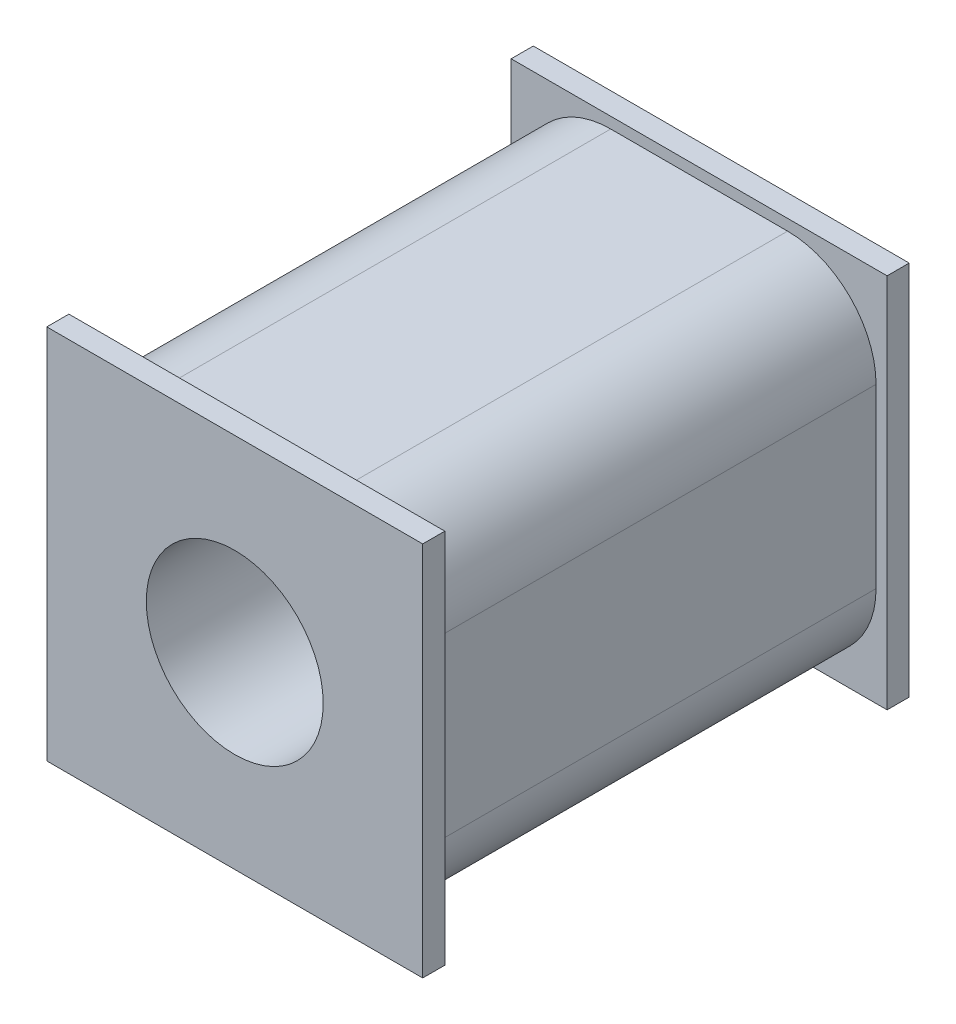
from build123d import *

# Parameters (mm, degrees)
ESQUISSE1_W             = 8
ESQUISSE1_H             = 8
ESQUISSE1_R             = 2
BASE_EXTRUSION_DEPTH    = 10
CONG_1_R                = 2
ESQUISSE2_W             = 8.5
ESQUISSE2_H             = 8.5
BOSS_EXTRU_1_DEPTH      = 0.5
ESQUISSE3_R             = 2
ENL_V_MAT_EXTRU_1_DEPTH = 13.534951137


with BuildPart() as part:
    # Esquisse1 → Base-Extrusion (new body)
    with BuildSketch(Plane.XY):
        Rectangle(ESQUISSE1_W, ESQUISSE1_H)
        with Locations(Location((0, 0, 0), (0, 0, 180))):
            Circle(ESQUISSE1_R, mode=Mode.SUBTRACT)
    extrude(amount=BASE_EXTRUSION_DEPTH)

    # Cong_1
    cong_1_edges = [part.edges().sort_by_distance(p)[0] for p in [
        (-4, 4, 5),
        (4, 4, 5),
        (4, -4, 5),
        (-4, -4, 5),
    ]]
    fillet(cong_1_edges, radius=CONG_1_R)

    # Esquisse2 → Boss.-Extru.1 (add)
    with BuildSketch(Plane.XY.offset(10)):
        Rectangle(ESQUISSE2_W, ESQUISSE2_H)
    boss_extru_1 = extrude(amount=BOSS_EXTRU_1_DEPTH)

    # Sym_trie1: Boss.-Extru.1 across plane
    add(boss_extru_1.mirror(Plane.XY.offset(5)))

    # Esquisse3 → Enl_v. mat.-Extru.1 (cut, through all)
    with BuildSketch(Plane(origin=(0, 0, -0.5), x_dir=(-1, 0, 0), z_dir=(0, 0, -1))):
        Circle(ESQUISSE3_R)
    extrude(amount=-ENL_V_MAT_EXTRU_1_DEPTH, mode=Mode.SUBTRACT)


solid = part.part
